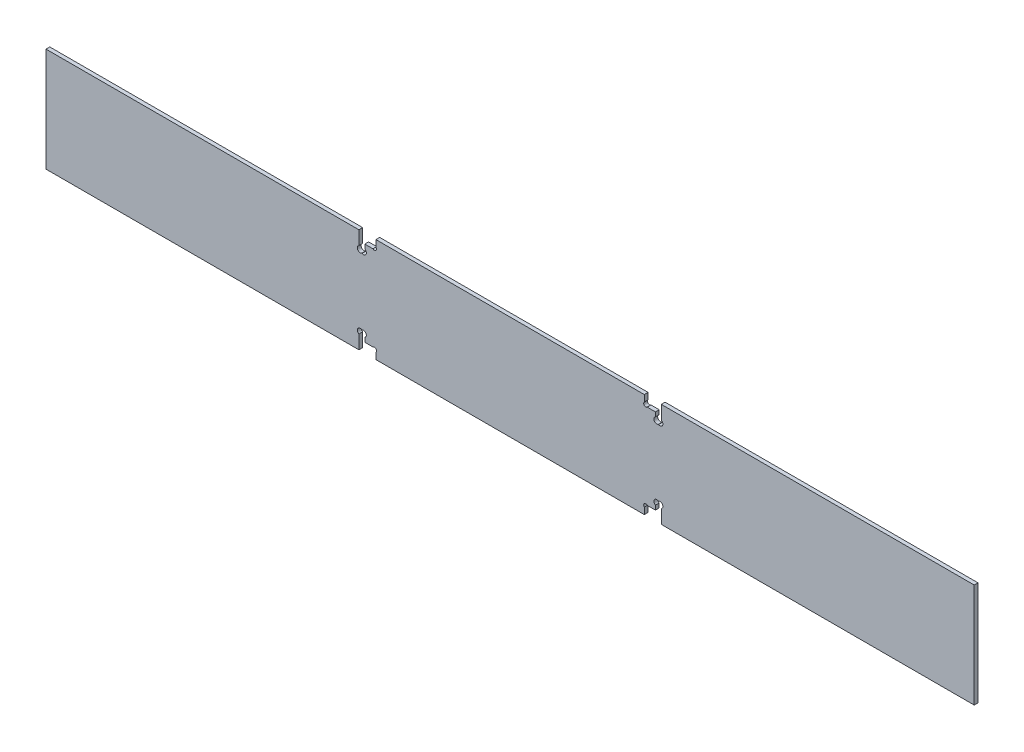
ISO-10303-21;
HEADER;
FILE_DESCRIPTION(('STEP AP214'),'2;1');
FILE_NAME('part.step','',(''),(''),'','','');
FILE_SCHEMA(('AUTOMOTIVE_DESIGN { 1 0 10303 214 1 1 1 1 }'));
ENDSEC;
DATA;
#1=APPLICATION_CONTEXT('core data for automotive mechanical design processes');
#2=APPLICATION_PROTOCOL_DEFINITION('international standard','automotive_design',2000,#1);
#3=PRODUCT_CONTEXT('',#1,'mechanical');
#4=PRODUCT('Part','Part','',(#3));
#5=PRODUCT_RELATED_PRODUCT_CATEGORY('part','',(#4));
#6=PRODUCT_DEFINITION_FORMATION('','',#4);
#7=PRODUCT_DEFINITION_CONTEXT('part definition',#1,'design');
#8=PRODUCT_DEFINITION('design','',#6,#7);
#9=PRODUCT_DEFINITION_SHAPE('','',#8);
#10=(LENGTH_UNIT() NAMED_UNIT(*) SI_UNIT(.MILLI.,.METRE.));
#11=(NAMED_UNIT(*) PLANE_ANGLE_UNIT() SI_UNIT($,.RADIAN.));
#12=(NAMED_UNIT(*) SI_UNIT($,.STERADIAN.) SOLID_ANGLE_UNIT());
#13=UNCERTAINTY_MEASURE_WITH_UNIT(LENGTH_MEASURE(1.E-05),#10,'distance_accuracy_value','');
#14=(GEOMETRIC_REPRESENTATION_CONTEXT(3) GLOBAL_UNCERTAINTY_ASSIGNED_CONTEXT((#13)) GLOBAL_UNIT_ASSIGNED_CONTEXT((#10,
#11,#12)) REPRESENTATION_CONTEXT('',''));
#15=CARTESIAN_POINT('',(0.,0.,0.));
#16=DIRECTION('',(0.,0.,1.));
#17=DIRECTION('',(1.,0.,0.));
#18=AXIS2_PLACEMENT_3D('',#15,#16,#17);
#19=CARTESIAN_POINT('',(-0.5,0.,2.));
#20=DIRECTION('',(1.,0.,0.));
#21=DIRECTION('',(0.,0.,-1.));
#22=AXIS2_PLACEMENT_3D('',#19,#20,#21);
#23=PLANE('',#22);
#24=DIRECTION('',(0.,-1.,0.));
#25=VECTOR('',#24,1.);
#26=CARTESIAN_POINT('',(-0.5,0.,0.));
#27=LINE('',#26,#25);
#28=CARTESIAN_POINT('',(-0.5,55.,0.));
#29=VERTEX_POINT('',#28);
#30=CARTESIAN_POINT('',(-0.5,0.,0.));
#31=VERTEX_POINT('',#30);
#32=EDGE_CURVE('E286',#29,#31,#27,.T.);
#33=ORIENTED_EDGE('',*,*,#32,.T.);
#34=DIRECTION('',(0.,0.,-1.));
#35=VECTOR('',#34,1.);
#36=CARTESIAN_POINT('',(-0.5,0.,2.));
#37=LINE('',#36,#35);
#38=CARTESIAN_POINT('',(-0.5,0.,2.));
#39=VERTEX_POINT('',#38);
#40=EDGE_CURVE('E11',#39,#31,#37,.T.);
#41=ORIENTED_EDGE('',*,*,#40,.F.);
#42=DIRECTION('',(0.,-1.,0.));
#43=VECTOR('',#42,1.);
#44=CARTESIAN_POINT('',(-0.5,0.,2.));
#45=LINE('',#44,#43);
#46=CARTESIAN_POINT('',(-0.5,55.,2.));
#47=VERTEX_POINT('',#46);
#48=EDGE_CURVE('E377',#47,#39,#45,.T.);
#49=ORIENTED_EDGE('',*,*,#48,.F.);
#50=DIRECTION('',(0.,0.,-1.));
#51=VECTOR('',#50,1.);
#52=CARTESIAN_POINT('',(-0.5,55.,2.));
#53=LINE('',#52,#51);
#54=EDGE_CURVE('E299',#47,#29,#53,.T.);
#55=ORIENTED_EDGE('',*,*,#54,.T.);
#56=EDGE_LOOP('',(#33,#41,#49,#55));
#57=FACE_BOUND('',#56,.T.);
#58=ADVANCED_FACE('F26',(#57),#23,.F.);
#59=CARTESIAN_POINT('',(-0.5,0.,2.));
#60=DIRECTION('',(0.,1.,0.));
#61=DIRECTION('',(0.,0.,1.));
#62=AXIS2_PLACEMENT_3D('',#59,#60,#61);
#63=PLANE('',#62);
#64=DIRECTION('',(1.,0.,0.));
#65=VECTOR('',#64,1.);
#66=CARTESIAN_POINT('',(-0.5,0.,0.));
#67=LINE('',#66,#65);
#68=CARTESIAN_POINT('',(165.014156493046,0.,0.));
#69=VERTEX_POINT('',#68);
#70=EDGE_CURVE('E282',#31,#69,#67,.T.);
#71=ORIENTED_EDGE('',*,*,#70,.T.);
#72=DIRECTION('',(0.,0.,-1.));
#73=VECTOR('',#72,1.);
#74=CARTESIAN_POINT('',(165.014156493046,0.,2.));
#75=LINE('',#74,#73);
#76=CARTESIAN_POINT('',(165.014156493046,0.,2.));
#77=VERTEX_POINT('',#76);
#78=EDGE_CURVE('E33',#77,#69,#75,.T.);
#79=ORIENTED_EDGE('',*,*,#78,.F.);
#80=DIRECTION('',(1.,0.,0.));
#81=VECTOR('',#80,1.);
#82=CARTESIAN_POINT('',(-0.5,0.,2.));
#83=LINE('',#82,#81);
#84=EDGE_CURVE('E295',#39,#77,#83,.T.);
#85=ORIENTED_EDGE('',*,*,#84,.F.);
#86=ORIENTED_EDGE('',*,*,#40,.T.);
#87=EDGE_LOOP('',(#71,#79,#85,#86));
#88=FACE_BOUND('',#87,.T.);
#89=ADVANCED_FACE('F294',(#88),#63,.F.);
#90=CARTESIAN_POINT('',(165.014156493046,7.26886275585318,2.));
#91=DIRECTION('',(-1.,0.,0.));
#92=DIRECTION('',(0.,0.,1.));
#93=AXIS2_PLACEMENT_3D('',#90,#91,#92);
#94=PLANE('',#93);
#95=DIRECTION('',(0.,1.,0.));
#96=VECTOR('',#95,1.);
#97=CARTESIAN_POINT('',(165.014156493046,7.26886275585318,0.));
#98=LINE('',#97,#96);
#99=CARTESIAN_POINT('',(165.014156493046,7.26886275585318,0.));
#100=VERTEX_POINT('',#99);
#101=EDGE_CURVE('E288',#69,#100,#98,.T.);
#102=ORIENTED_EDGE('',*,*,#101,.T.);
#103=DIRECTION('',(0.,0.,-1.));
#104=VECTOR('',#103,1.);
#105=CARTESIAN_POINT('',(165.014156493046,7.26886275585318,2.));
#106=LINE('',#105,#104);
#107=CARTESIAN_POINT('',(165.014156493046,7.26886275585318,2.));
#108=VERTEX_POINT('',#107);
#109=EDGE_CURVE('E563',#108,#100,#106,.T.);
#110=ORIENTED_EDGE('',*,*,#109,.F.);
#111=DIRECTION('',(0.,1.,0.));
#112=VECTOR('',#111,1.);
#113=CARTESIAN_POINT('',(165.014156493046,7.26886275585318,2.));
#114=LINE('',#113,#112);
#115=EDGE_CURVE('E380',#77,#108,#114,.T.);
#116=ORIENTED_EDGE('',*,*,#115,.F.);
#117=ORIENTED_EDGE('',*,*,#78,.T.);
#118=EDGE_LOOP('',(#102,#110,#116,#117));
#119=FACE_BOUND('',#118,.T.);
#120=ADVANCED_FACE('F567',(#119),#94,.F.);
#121=CARTESIAN_POINT('',(165.720697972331,8.64846383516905,2.));
#122=DIRECTION('',(0.,0.,-1.));
#123=DIRECTION('',(-1.,0.,0.));
#124=AXIS2_PLACEMENT_3D('',#121,#122,#123);
#125=CYLINDRICAL_SURFACE('',#124,1.55);
#126=CARTESIAN_POINT('',(165.720697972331,8.64846383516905,0.));
#127=DIRECTION('',(0.,0.,-1.));
#128=DIRECTION('',(1.,0.,0.));
#129=AXIS2_PLACEMENT_3D('',#126,#127,#128);
#130=CIRCLE('',#129,1.55);
#131=CARTESIAN_POINT('',(166.479545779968,10.,0.));
#132=VERTEX_POINT('',#131);
#133=EDGE_CURVE('E303',#100,#132,#130,.T.);
#134=ORIENTED_EDGE('',*,*,#133,.T.);
#135=DIRECTION('',(0.,0.,-1.));
#136=VECTOR('',#135,1.);
#137=CARTESIAN_POINT('',(166.479545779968,10.,2.));
#138=LINE('',#137,#136);
#139=CARTESIAN_POINT('',(166.479545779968,10.,2.));
#140=VERTEX_POINT('',#139);
#141=EDGE_CURVE('E560',#140,#132,#138,.T.);
#142=ORIENTED_EDGE('',*,*,#141,.F.);
#143=CARTESIAN_POINT('',(165.720697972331,8.64846383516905,2.));
#144=DIRECTION('',(0.,0.,-1.));
#145=DIRECTION('',(1.,0.,0.));
#146=AXIS2_PLACEMENT_3D('',#143,#144,#145);
#147=CIRCLE('',#146,1.55);
#148=EDGE_CURVE('E382',#108,#140,#147,.T.);
#149=ORIENTED_EDGE('',*,*,#148,.F.);
#150=ORIENTED_EDGE('',*,*,#109,.T.);
#151=EDGE_LOOP('',(#134,#142,#149,#150));
#152=FACE_BOUND('',#151,.T.);
#153=ADVANCED_FACE('F575',(#152),#125,.F.);
#154=CARTESIAN_POINT('',(166.479545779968,10.,2.));
#155=DIRECTION('',(0.,1.,0.));
#156=DIRECTION('',(0.,0.,1.));
#157=AXIS2_PLACEMENT_3D('',#154,#155,#156);
#158=PLANE('',#157);
#159=DIRECTION('',(1.,0.,0.));
#160=VECTOR('',#159,1.);
#161=CARTESIAN_POINT('',(166.479545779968,10.,0.));
#162=LINE('',#161,#160);
#163=CARTESIAN_POINT('',(166.648767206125,10.,0.));
#164=VERTEX_POINT('',#163);
#165=EDGE_CURVE('E305',#132,#164,#162,.T.);
#166=ORIENTED_EDGE('',*,*,#165,.T.);
#167=DIRECTION('',(0.,0.,-1.));
#168=VECTOR('',#167,1.);
#169=CARTESIAN_POINT('',(166.648767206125,10.,2.));
#170=LINE('',#169,#168);
#171=CARTESIAN_POINT('',(166.648767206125,10.,2.));
#172=VERTEX_POINT('',#171);
#173=EDGE_CURVE('E557',#172,#164,#170,.T.);
#174=ORIENTED_EDGE('',*,*,#173,.F.);
#175=DIRECTION('',(1.,0.,0.));
#176=VECTOR('',#175,1.);
#177=CARTESIAN_POINT('',(166.479545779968,10.,2.));
#178=LINE('',#177,#176);
#179=EDGE_CURVE('E384',#140,#172,#178,.T.);
#180=ORIENTED_EDGE('',*,*,#179,.F.);
#181=ORIENTED_EDGE('',*,*,#141,.T.);
#182=EDGE_LOOP('',(#166,#174,#180,#181));
#183=FACE_BOUND('',#182,.T.);
#184=ADVANCED_FACE('F578',(#183),#158,.F.);
#185=CARTESIAN_POINT('',(167.407615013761,8.64846383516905,2.));
#186=DIRECTION('',(0.,0.,-1.));
#187=DIRECTION('',(-1.,0.,0.));
#188=AXIS2_PLACEMENT_3D('',#185,#186,#187);
#189=CYLINDRICAL_SURFACE('',#188,1.55);
#190=CARTESIAN_POINT('',(167.407615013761,8.64846383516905,0.));
#191=DIRECTION('',(0.,0.,-1.));
#192=DIRECTION('',(-1.,0.,0.));
#193=AXIS2_PLACEMENT_3D('',#190,#191,#192);
#194=CIRCLE('',#193,1.55);
#195=CARTESIAN_POINT('',(168.114156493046,7.26886275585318,0.));
#196=VERTEX_POINT('',#195);
#197=EDGE_CURVE('E307',#164,#196,#194,.T.);
#198=ORIENTED_EDGE('',*,*,#197,.T.);
#199=DIRECTION('',(0.,0.,-1.));
#200=VECTOR('',#199,1.);
#201=CARTESIAN_POINT('',(168.114156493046,7.26886275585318,2.));
#202=LINE('',#201,#200);
#203=CARTESIAN_POINT('',(168.114156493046,7.26886275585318,2.));
#204=VERTEX_POINT('',#203);
#205=EDGE_CURVE('E554',#204,#196,#202,.T.);
#206=ORIENTED_EDGE('',*,*,#205,.F.);
#207=CARTESIAN_POINT('',(167.407615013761,8.64846383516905,2.));
#208=DIRECTION('',(0.,0.,-1.));
#209=DIRECTION('',(-1.,0.,0.));
#210=AXIS2_PLACEMENT_3D('',#207,#208,#209);
#211=CIRCLE('',#210,1.55);
#212=EDGE_CURVE('E386',#172,#204,#211,.T.);
#213=ORIENTED_EDGE('',*,*,#212,.F.);
#214=ORIENTED_EDGE('',*,*,#173,.T.);
#215=EDGE_LOOP('',(#198,#206,#213,#214));
#216=FACE_BOUND('',#215,.T.);
#217=ADVANCED_FACE('F583',(#216),#189,.F.);
#218=CARTESIAN_POINT('',(168.114156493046,7.26886275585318,2.));
#219=DIRECTION('',(1.,0.,0.));
#220=DIRECTION('',(0.,0.,-1.));
#221=AXIS2_PLACEMENT_3D('',#218,#219,#220);
#222=PLANE('',#221);
#223=DIRECTION('',(0.,-1.,0.));
#224=VECTOR('',#223,1.);
#225=CARTESIAN_POINT('',(168.114156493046,7.26886275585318,0.));
#226=LINE('',#225,#224);
#227=CARTESIAN_POINT('',(168.114156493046,5.,0.));
#228=VERTEX_POINT('',#227);
#229=EDGE_CURVE('E309',#196,#228,#226,.T.);
#230=ORIENTED_EDGE('',*,*,#229,.T.);
#231=DIRECTION('',(0.,0.,-1.));
#232=VECTOR('',#231,1.);
#233=CARTESIAN_POINT('',(168.114156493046,5.,2.));
#234=LINE('',#233,#232);
#235=CARTESIAN_POINT('',(168.114156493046,5.,2.));
#236=VERTEX_POINT('',#235);
#237=EDGE_CURVE('E551',#236,#228,#234,.T.);
#238=ORIENTED_EDGE('',*,*,#237,.F.);
#239=DIRECTION('',(0.,-1.,0.));
#240=VECTOR('',#239,1.);
#241=CARTESIAN_POINT('',(168.114156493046,7.26886275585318,2.));
#242=LINE('',#241,#240);
#243=EDGE_CURVE('E388',#204,#236,#242,.T.);
#244=ORIENTED_EDGE('',*,*,#243,.F.);
#245=ORIENTED_EDGE('',*,*,#205,.T.);
#246=EDGE_LOOP('',(#230,#238,#244,#245));
#247=FACE_BOUND('',#246,.T.);
#248=ADVANCED_FACE('F589',(#247),#222,.F.);
#249=CARTESIAN_POINT('',(168.114156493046,5.,2.));
#250=DIRECTION('',(0.,1.,0.));
#251=DIRECTION('',(0.,0.,1.));
#252=AXIS2_PLACEMENT_3D('',#249,#250,#251);
#253=PLANE('',#252);
#254=DIRECTION('',(1.,0.,0.));
#255=VECTOR('',#254,1.);
#256=CARTESIAN_POINT('',(168.114156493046,5.,0.));
#257=LINE('',#256,#255);
#258=CARTESIAN_POINT('',(172.44436508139,5.,0.));
#259=VERTEX_POINT('',#258);
#260=EDGE_CURVE('E311',#228,#259,#257,.T.);
#261=ORIENTED_EDGE('',*,*,#260,.T.);
#262=DIRECTION('',(0.,0.,-1.));
#263=VECTOR('',#262,1.);
#264=CARTESIAN_POINT('',(172.44436508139,5.,2.));
#265=LINE('',#264,#263);
#266=CARTESIAN_POINT('',(172.44436508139,5.,2.));
#267=VERTEX_POINT('',#266);
#268=EDGE_CURVE('E548',#267,#259,#265,.T.);
#269=ORIENTED_EDGE('',*,*,#268,.F.);
#270=DIRECTION('',(1.,0.,0.));
#271=VECTOR('',#270,1.);
#272=CARTESIAN_POINT('',(168.114156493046,5.,2.));
#273=LINE('',#272,#271);
#274=EDGE_CURVE('E390',#236,#267,#273,.T.);
#275=ORIENTED_EDGE('',*,*,#274,.F.);
#276=ORIENTED_EDGE('',*,*,#237,.T.);
#277=EDGE_LOOP('',(#261,#269,#275,#276));
#278=FACE_BOUND('',#277,.T.);
#279=ADVANCED_FACE('F593',(#278),#253,.F.);
#280=CARTESIAN_POINT('',(173.229260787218,4.21510429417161,2.));
#281=DIRECTION('',(0.,0.,-1.));
#282=DIRECTION('',(-1.,0.,0.));
#283=AXIS2_PLACEMENT_3D('',#280,#281,#282);
#284=CYLINDRICAL_SURFACE('',#283,1.1100101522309);
#285=CARTESIAN_POINT('',(173.229260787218,4.21510429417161,0.));
#286=DIRECTION('',(0.,0.,-1.));
#287=DIRECTION('',(1.,0.,0.));
#288=AXIS2_PLACEMENT_3D('',#285,#286,#287);
#289=CIRCLE('',#288,1.1100101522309);
#290=CARTESIAN_POINT('',(174.014156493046,3.43020858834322,0.));
#291=VERTEX_POINT('',#290);
#292=EDGE_CURVE('E313',#259,#291,#289,.T.);
#293=ORIENTED_EDGE('',*,*,#292,.T.);
#294=DIRECTION('',(0.,0.,-1.));
#295=VECTOR('',#294,1.);
#296=CARTESIAN_POINT('',(174.014156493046,3.43020858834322,2.));
#297=LINE('',#296,#295);
#298=CARTESIAN_POINT('',(174.014156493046,3.43020858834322,2.));
#299=VERTEX_POINT('',#298);
#300=EDGE_CURVE('E545',#299,#291,#297,.T.);
#301=ORIENTED_EDGE('',*,*,#300,.F.);
#302=CARTESIAN_POINT('',(173.229260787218,4.21510429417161,2.));
#303=DIRECTION('',(0.,0.,-1.));
#304=DIRECTION('',(1.,0.,0.));
#305=AXIS2_PLACEMENT_3D('',#302,#303,#304);
#306=CIRCLE('',#305,1.1100101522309);
#307=EDGE_CURVE('E392',#267,#299,#306,.T.);
#308=ORIENTED_EDGE('',*,*,#307,.F.);
#309=ORIENTED_EDGE('',*,*,#268,.T.);
#310=EDGE_LOOP('',(#293,#301,#308,#309));
#311=FACE_BOUND('',#310,.T.);
#312=ADVANCED_FACE('F598',(#311),#284,.F.);
#313=CARTESIAN_POINT('',(174.014156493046,3.43020858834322,2.));
#314=DIRECTION('',(1.,0.,0.));
#315=DIRECTION('',(0.,0.,-1.));
#316=AXIS2_PLACEMENT_3D('',#313,#314,#315);
#317=PLANE('',#316);
#318=DIRECTION('',(0.,-1.,0.));
#319=VECTOR('',#318,1.);
#320=CARTESIAN_POINT('',(174.014156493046,3.43020858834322,0.));
#321=LINE('',#320,#319);
#322=CARTESIAN_POINT('',(174.014156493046,0.,0.));
#323=VERTEX_POINT('',#322);
#324=EDGE_CURVE('E315',#291,#323,#321,.T.);
#325=ORIENTED_EDGE('',*,*,#324,.T.);
#326=DIRECTION('',(0.,0.,-1.));
#327=VECTOR('',#326,1.);
#328=CARTESIAN_POINT('',(174.014156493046,0.,2.));
#329=LINE('',#328,#327);
#330=CARTESIAN_POINT('',(174.014156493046,0.,2.));
#331=VERTEX_POINT('',#330);
#332=EDGE_CURVE('E542',#331,#323,#329,.T.);
#333=ORIENTED_EDGE('',*,*,#332,.F.);
#334=DIRECTION('',(0.,-1.,0.));
#335=VECTOR('',#334,1.);
#336=CARTESIAN_POINT('',(174.014156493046,3.43020858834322,2.));
#337=LINE('',#336,#335);
#338=EDGE_CURVE('E394',#299,#331,#337,.T.);
#339=ORIENTED_EDGE('',*,*,#338,.F.);
#340=ORIENTED_EDGE('',*,*,#300,.T.);
#341=EDGE_LOOP('',(#325,#333,#339,#340));
#342=FACE_BOUND('',#341,.T.);
#343=ADVANCED_FACE('F604',(#342),#317,.F.);
#344=CARTESIAN_POINT('',(174.014156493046,0.,2.));
#345=DIRECTION('',(0.,1.,0.));
#346=DIRECTION('',(0.,0.,1.));
#347=AXIS2_PLACEMENT_3D('',#344,#345,#346);
#348=PLANE('',#347);
#349=DIRECTION('',(1.,0.,0.));
#350=VECTOR('',#349,1.);
#351=CARTESIAN_POINT('',(174.014156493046,0.,0.));
#352=LINE('',#351,#350);
#353=CARTESIAN_POINT('',(315.985843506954,0.,0.));
#354=VERTEX_POINT('',#353);
#355=EDGE_CURVE('E317',#323,#354,#352,.T.);
#356=ORIENTED_EDGE('',*,*,#355,.T.);
#357=DIRECTION('',(0.,0.,-1.));
#358=VECTOR('',#357,1.);
#359=CARTESIAN_POINT('',(315.985843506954,0.,2.));
#360=LINE('',#359,#358);
#361=CARTESIAN_POINT('',(315.985843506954,0.,2.));
#362=VERTEX_POINT('',#361);
#363=EDGE_CURVE('E539',#362,#354,#360,.T.);
#364=ORIENTED_EDGE('',*,*,#363,.F.);
#365=DIRECTION('',(1.,0.,0.));
#366=VECTOR('',#365,1.);
#367=CARTESIAN_POINT('',(174.014156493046,0.,2.));
#368=LINE('',#367,#366);
#369=EDGE_CURVE('E396',#331,#362,#368,.T.);
#370=ORIENTED_EDGE('',*,*,#369,.F.);
#371=ORIENTED_EDGE('',*,*,#332,.T.);
#372=EDGE_LOOP('',(#356,#364,#370,#371));
#373=FACE_BOUND('',#372,.T.);
#374=ADVANCED_FACE('F608',(#373),#348,.F.);
#375=CARTESIAN_POINT('',(315.985843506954,3.43020858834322,2.));
#376=DIRECTION('',(-1.,0.,0.));
#377=DIRECTION('',(0.,0.,1.));
#378=AXIS2_PLACEMENT_3D('',#375,#376,#377);
#379=PLANE('',#378);
#380=DIRECTION('',(0.,1.,0.));
#381=VECTOR('',#380,1.);
#382=CARTESIAN_POINT('',(315.985843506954,3.43020858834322,0.));
#383=LINE('',#382,#381);
#384=CARTESIAN_POINT('',(315.985843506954,3.43020858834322,0.));
#385=VERTEX_POINT('',#384);
#386=EDGE_CURVE('E319',#354,#385,#383,.T.);
#387=ORIENTED_EDGE('',*,*,#386,.T.);
#388=DIRECTION('',(0.,0.,-1.));
#389=VECTOR('',#388,1.);
#390=CARTESIAN_POINT('',(315.985843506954,3.43020858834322,2.));
#391=LINE('',#390,#389);
#392=CARTESIAN_POINT('',(315.985843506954,3.43020858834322,2.));
#393=VERTEX_POINT('',#392);
#394=EDGE_CURVE('E536',#393,#385,#391,.T.);
#395=ORIENTED_EDGE('',*,*,#394,.F.);
#396=DIRECTION('',(0.,1.,0.));
#397=VECTOR('',#396,1.);
#398=CARTESIAN_POINT('',(315.985843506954,3.43020858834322,2.));
#399=LINE('',#398,#397);
#400=EDGE_CURVE('E398',#362,#393,#399,.T.);
#401=ORIENTED_EDGE('',*,*,#400,.F.);
#402=ORIENTED_EDGE('',*,*,#363,.T.);
#403=EDGE_LOOP('',(#387,#395,#401,#402));
#404=FACE_BOUND('',#403,.T.);
#405=ADVANCED_FACE('F613',(#404),#379,.F.);
#406=CARTESIAN_POINT('',(316.770739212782,4.21510429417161,2.));
#407=DIRECTION('',(0.,0.,-1.));
#408=DIRECTION('',(-1.,0.,0.));
#409=AXIS2_PLACEMENT_3D('',#406,#407,#408);
#410=CYLINDRICAL_SURFACE('',#409,1.11001015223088);
#411=CARTESIAN_POINT('',(316.770739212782,4.21510429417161,0.));
#412=DIRECTION('',(0.,0.,-1.));
#413=DIRECTION('',(-1.,0.,0.));
#414=AXIS2_PLACEMENT_3D('',#411,#412,#413);
#415=CIRCLE('',#414,1.11001015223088);
#416=CARTESIAN_POINT('',(317.55563491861,5.,0.));
#417=VERTEX_POINT('',#416);
#418=EDGE_CURVE('E321',#385,#417,#415,.T.);
#419=ORIENTED_EDGE('',*,*,#418,.T.);
#420=DIRECTION('',(0.,0.,-1.));
#421=VECTOR('',#420,1.);
#422=CARTESIAN_POINT('',(317.55563491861,5.,2.));
#423=LINE('',#422,#421);
#424=CARTESIAN_POINT('',(317.55563491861,5.,2.));
#425=VERTEX_POINT('',#424);
#426=EDGE_CURVE('E533',#425,#417,#423,.T.);
#427=ORIENTED_EDGE('',*,*,#426,.F.);
#428=CARTESIAN_POINT('',(316.770739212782,4.21510429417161,2.));
#429=DIRECTION('',(0.,0.,-1.));
#430=DIRECTION('',(-1.,0.,0.));
#431=AXIS2_PLACEMENT_3D('',#428,#429,#430);
#432=CIRCLE('',#431,1.11001015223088);
#433=EDGE_CURVE('E400',#393,#425,#432,.T.);
#434=ORIENTED_EDGE('',*,*,#433,.F.);
#435=ORIENTED_EDGE('',*,*,#394,.T.);
#436=EDGE_LOOP('',(#419,#427,#434,#435));
#437=FACE_BOUND('',#436,.T.);
#438=ADVANCED_FACE('F619',(#437),#410,.F.);
#439=CARTESIAN_POINT('',(321.885843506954,5.,2.));
#440=DIRECTION('',(0.,1.,0.));
#441=DIRECTION('',(0.,0.,1.));
#442=AXIS2_PLACEMENT_3D('',#439,#440,#441);
#443=PLANE('',#442);
#444=DIRECTION('',(1.,0.,0.));
#445=VECTOR('',#444,1.);
#446=CARTESIAN_POINT('',(321.885843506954,5.,0.));
#447=LINE('',#446,#445);
#448=CARTESIAN_POINT('',(321.885843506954,5.,0.));
#449=VERTEX_POINT('',#448);
#450=EDGE_CURVE('E323',#417,#449,#447,.T.);
#451=ORIENTED_EDGE('',*,*,#450,.T.);
#452=DIRECTION('',(0.,0.,-1.));
#453=VECTOR('',#452,1.);
#454=CARTESIAN_POINT('',(321.885843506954,5.,2.));
#455=LINE('',#454,#453);
#456=CARTESIAN_POINT('',(321.885843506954,5.,2.));
#457=VERTEX_POINT('',#456);
#458=EDGE_CURVE('E530',#457,#449,#455,.T.);
#459=ORIENTED_EDGE('',*,*,#458,.F.);
#460=DIRECTION('',(1.,0.,0.));
#461=VECTOR('',#460,1.);
#462=CARTESIAN_POINT('',(321.885843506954,5.,2.));
#463=LINE('',#462,#461);
#464=EDGE_CURVE('E402',#425,#457,#463,.T.);
#465=ORIENTED_EDGE('',*,*,#464,.F.);
#466=ORIENTED_EDGE('',*,*,#426,.T.);
#467=EDGE_LOOP('',(#451,#459,#465,#466));
#468=FACE_BOUND('',#467,.T.);
#469=ADVANCED_FACE('F623',(#468),#443,.F.);
#470=CARTESIAN_POINT('',(321.885843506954,7.26886275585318,2.));
#471=DIRECTION('',(-1.,0.,0.));
#472=DIRECTION('',(0.,0.,1.));
#473=AXIS2_PLACEMENT_3D('',#470,#471,#472);
#474=PLANE('',#473);
#475=DIRECTION('',(0.,1.,0.));
#476=VECTOR('',#475,1.);
#477=CARTESIAN_POINT('',(321.885843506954,7.26886275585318,0.));
#478=LINE('',#477,#476);
#479=CARTESIAN_POINT('',(321.885843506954,7.26886275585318,0.));
#480=VERTEX_POINT('',#479);
#481=EDGE_CURVE('E325',#449,#480,#478,.T.);
#482=ORIENTED_EDGE('',*,*,#481,.T.);
#483=DIRECTION('',(0.,0.,-1.));
#484=VECTOR('',#483,1.);
#485=CARTESIAN_POINT('',(321.885843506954,7.26886275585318,2.));
#486=LINE('',#485,#484);
#487=CARTESIAN_POINT('',(321.885843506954,7.26886275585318,2.));
#488=VERTEX_POINT('',#487);
#489=EDGE_CURVE('E527',#488,#480,#486,.T.);
#490=ORIENTED_EDGE('',*,*,#489,.F.);
#491=DIRECTION('',(0.,1.,0.));
#492=VECTOR('',#491,1.);
#493=CARTESIAN_POINT('',(321.885843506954,7.26886275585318,2.));
#494=LINE('',#493,#492);
#495=EDGE_CURVE('E404',#457,#488,#494,.T.);
#496=ORIENTED_EDGE('',*,*,#495,.F.);
#497=ORIENTED_EDGE('',*,*,#458,.T.);
#498=EDGE_LOOP('',(#482,#490,#496,#497));
#499=FACE_BOUND('',#498,.T.);
#500=ADVANCED_FACE('F628',(#499),#474,.F.);
#501=CARTESIAN_POINT('',(322.592384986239,8.64846383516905,2.));
#502=DIRECTION('',(0.,0.,-1.));
#503=DIRECTION('',(-1.,0.,0.));
#504=AXIS2_PLACEMENT_3D('',#501,#502,#503);
#505=CYLINDRICAL_SURFACE('',#504,1.54999999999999);
#506=CARTESIAN_POINT('',(322.592384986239,8.64846383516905,0.));
#507=DIRECTION('',(0.,0.,-1.));
#508=DIRECTION('',(1.,0.,0.));
#509=AXIS2_PLACEMENT_3D('',#506,#507,#508);
#510=CIRCLE('',#509,1.54999999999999);
#511=CARTESIAN_POINT('',(323.351232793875,10.,0.));
#512=VERTEX_POINT('',#511);
#513=EDGE_CURVE('E327',#480,#512,#510,.T.);
#514=ORIENTED_EDGE('',*,*,#513,.T.);
#515=DIRECTION('',(0.,0.,-1.));
#516=VECTOR('',#515,1.);
#517=CARTESIAN_POINT('',(323.351232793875,10.,2.));
#518=LINE('',#517,#516);
#519=CARTESIAN_POINT('',(323.351232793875,10.,2.));
#520=VERTEX_POINT('',#519);
#521=EDGE_CURVE('E524',#520,#512,#518,.T.);
#522=ORIENTED_EDGE('',*,*,#521,.F.);
#523=CARTESIAN_POINT('',(322.592384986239,8.64846383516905,2.));
#524=DIRECTION('',(0.,0.,-1.));
#525=DIRECTION('',(1.,0.,0.));
#526=AXIS2_PLACEMENT_3D('',#523,#524,#525);
#527=CIRCLE('',#526,1.54999999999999);
#528=EDGE_CURVE('E406',#488,#520,#527,.T.);
#529=ORIENTED_EDGE('',*,*,#528,.F.);
#530=ORIENTED_EDGE('',*,*,#489,.T.);
#531=EDGE_LOOP('',(#514,#522,#529,#530));
#532=FACE_BOUND('',#531,.T.);
#533=ADVANCED_FACE('F634',(#532),#505,.F.);
#534=CARTESIAN_POINT('',(323.520454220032,10.,2.));
#535=DIRECTION('',(0.,1.,0.));
#536=DIRECTION('',(0.,0.,1.));
#537=AXIS2_PLACEMENT_3D('',#534,#535,#536);
#538=PLANE('',#537);
#539=DIRECTION('',(1.,0.,0.));
#540=VECTOR('',#539,1.);
#541=CARTESIAN_POINT('',(323.520454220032,10.,0.));
#542=LINE('',#541,#540);
#543=CARTESIAN_POINT('',(323.520454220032,10.,0.));
#544=VERTEX_POINT('',#543);
#545=EDGE_CURVE('E329',#512,#544,#542,.T.);
#546=ORIENTED_EDGE('',*,*,#545,.T.);
#547=DIRECTION('',(0.,0.,-1.));
#548=VECTOR('',#547,1.);
#549=CARTESIAN_POINT('',(323.520454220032,10.,2.));
#550=LINE('',#549,#548);
#551=CARTESIAN_POINT('',(323.520454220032,10.,2.));
#552=VERTEX_POINT('',#551);
#553=EDGE_CURVE('E521',#552,#544,#550,.T.);
#554=ORIENTED_EDGE('',*,*,#553,.F.);
#555=DIRECTION('',(1.,0.,0.));
#556=VECTOR('',#555,1.);
#557=CARTESIAN_POINT('',(323.520454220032,10.,2.));
#558=LINE('',#557,#556);
#559=EDGE_CURVE('E408',#520,#552,#558,.T.);
#560=ORIENTED_EDGE('',*,*,#559,.F.);
#561=ORIENTED_EDGE('',*,*,#521,.T.);
#562=EDGE_LOOP('',(#546,#554,#560,#561));
#563=FACE_BOUND('',#562,.T.);
#564=ADVANCED_FACE('F638',(#563),#538,.F.);
#565=CARTESIAN_POINT('',(324.279302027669,8.64846383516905,2.));
#566=DIRECTION('',(0.,0.,-1.));
#567=DIRECTION('',(-1.,0.,0.));
#568=AXIS2_PLACEMENT_3D('',#565,#566,#567);
#569=CYLINDRICAL_SURFACE('',#568,1.55);
#570=CARTESIAN_POINT('',(324.279302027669,8.64846383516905,0.));
#571=DIRECTION('',(0.,0.,-1.));
#572=DIRECTION('',(-1.,0.,0.));
#573=AXIS2_PLACEMENT_3D('',#570,#571,#572);
#574=CIRCLE('',#573,1.55);
#575=CARTESIAN_POINT('',(324.985843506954,7.26886275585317,0.));
#576=VERTEX_POINT('',#575);
#577=EDGE_CURVE('E331',#544,#576,#574,.T.);
#578=ORIENTED_EDGE('',*,*,#577,.T.);
#579=DIRECTION('',(0.,0.,-1.));
#580=VECTOR('',#579,1.);
#581=CARTESIAN_POINT('',(324.985843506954,7.26886275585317,2.));
#582=LINE('',#581,#580);
#583=CARTESIAN_POINT('',(324.985843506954,7.26886275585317,2.));
#584=VERTEX_POINT('',#583);
#585=EDGE_CURVE('E518',#584,#576,#582,.T.);
#586=ORIENTED_EDGE('',*,*,#585,.F.);
#587=CARTESIAN_POINT('',(324.279302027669,8.64846383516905,2.));
#588=DIRECTION('',(0.,0.,-1.));
#589=DIRECTION('',(-1.,0.,0.));
#590=AXIS2_PLACEMENT_3D('',#587,#588,#589);
#591=CIRCLE('',#590,1.55);
#592=EDGE_CURVE('E410',#552,#584,#591,.T.);
#593=ORIENTED_EDGE('',*,*,#592,.F.);
#594=ORIENTED_EDGE('',*,*,#553,.T.);
#595=EDGE_LOOP('',(#578,#586,#593,#594));
#596=FACE_BOUND('',#595,.T.);
#597=ADVANCED_FACE('F643',(#596),#569,.F.);
#598=CARTESIAN_POINT('',(324.985843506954,7.26886275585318,2.));
#599=DIRECTION('',(1.,0.,0.));
#600=DIRECTION('',(0.,0.,-1.));
#601=AXIS2_PLACEMENT_3D('',#598,#599,#600);
#602=PLANE('',#601);
#603=DIRECTION('',(0.,-1.,0.));
#604=VECTOR('',#603,1.);
#605=CARTESIAN_POINT('',(324.985843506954,7.26886275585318,0.));
#606=LINE('',#605,#604);
#607=CARTESIAN_POINT('',(324.985843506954,0.,0.));
#608=VERTEX_POINT('',#607);
#609=EDGE_CURVE('E333',#576,#608,#606,.T.);
#610=ORIENTED_EDGE('',*,*,#609,.T.);
#611=DIRECTION('',(0.,0.,-1.));
#612=VECTOR('',#611,1.);
#613=CARTESIAN_POINT('',(324.985843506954,0.,2.));
#614=LINE('',#613,#612);
#615=CARTESIAN_POINT('',(324.985843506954,0.,2.));
#616=VERTEX_POINT('',#615);
#617=EDGE_CURVE('E515',#616,#608,#614,.T.);
#618=ORIENTED_EDGE('',*,*,#617,.F.);
#619=DIRECTION('',(0.,-1.,0.));
#620=VECTOR('',#619,1.);
#621=CARTESIAN_POINT('',(324.985843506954,7.26886275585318,2.));
#622=LINE('',#621,#620);
#623=EDGE_CURVE('E412',#584,#616,#622,.T.);
#624=ORIENTED_EDGE('',*,*,#623,.F.);
#625=ORIENTED_EDGE('',*,*,#585,.T.);
#626=EDGE_LOOP('',(#610,#618,#624,#625));
#627=FACE_BOUND('',#626,.T.);
#628=ADVANCED_FACE('F649',(#627),#602,.F.);
#629=CARTESIAN_POINT('',(324.985843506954,0.,2.));
#630=DIRECTION('',(0.,1.,0.));
#631=DIRECTION('',(0.,0.,1.));
#632=AXIS2_PLACEMENT_3D('',#629,#630,#631);
#633=PLANE('',#632);
#634=DIRECTION('',(1.,0.,0.));
#635=VECTOR('',#634,1.);
#636=CARTESIAN_POINT('',(324.985843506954,0.,0.));
#637=LINE('',#636,#635);
#638=CARTESIAN_POINT('',(490.5,0.,0.));
#639=VERTEX_POINT('',#638);
#640=EDGE_CURVE('E335',#608,#639,#637,.T.);
#641=ORIENTED_EDGE('',*,*,#640,.T.);
#642=DIRECTION('',(0.,0.,-1.));
#643=VECTOR('',#642,1.);
#644=CARTESIAN_POINT('',(490.5,0.,2.));
#645=LINE('',#644,#643);
#646=CARTESIAN_POINT('',(490.5,0.,2.));
#647=VERTEX_POINT('',#646);
#648=EDGE_CURVE('E512',#647,#639,#645,.T.);
#649=ORIENTED_EDGE('',*,*,#648,.F.);
#650=DIRECTION('',(1.,0.,0.));
#651=VECTOR('',#650,1.);
#652=CARTESIAN_POINT('',(324.985843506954,0.,2.));
#653=LINE('',#652,#651);
#654=EDGE_CURVE('E414',#616,#647,#653,.T.);
#655=ORIENTED_EDGE('',*,*,#654,.F.);
#656=ORIENTED_EDGE('',*,*,#617,.T.);
#657=EDGE_LOOP('',(#641,#649,#655,#656));
#658=FACE_BOUND('',#657,.T.);
#659=ADVANCED_FACE('F653',(#658),#633,.F.);
#660=CARTESIAN_POINT('',(490.5,0.,2.));
#661=DIRECTION('',(-1.,0.,0.));
#662=DIRECTION('',(0.,0.,1.));
#663=AXIS2_PLACEMENT_3D('',#660,#661,#662);
#664=PLANE('',#663);
#665=DIRECTION('',(0.,1.,0.));
#666=VECTOR('',#665,1.);
#667=CARTESIAN_POINT('',(490.5,0.,0.));
#668=LINE('',#667,#666);
#669=CARTESIAN_POINT('',(490.5,55.,0.));
#670=VERTEX_POINT('',#669);
#671=EDGE_CURVE('E337',#639,#670,#668,.T.);
#672=ORIENTED_EDGE('',*,*,#671,.T.);
#673=DIRECTION('',(0.,0.,-1.));
#674=VECTOR('',#673,1.);
#675=CARTESIAN_POINT('',(490.5,55.,2.));
#676=LINE('',#675,#674);
#677=CARTESIAN_POINT('',(490.5,55.,2.));
#678=VERTEX_POINT('',#677);
#679=EDGE_CURVE('E509',#678,#670,#676,.T.);
#680=ORIENTED_EDGE('',*,*,#679,.F.);
#681=DIRECTION('',(0.,1.,0.));
#682=VECTOR('',#681,1.);
#683=CARTESIAN_POINT('',(490.5,0.,2.));
#684=LINE('',#683,#682);
#685=EDGE_CURVE('E416',#647,#678,#684,.T.);
#686=ORIENTED_EDGE('',*,*,#685,.F.);
#687=ORIENTED_EDGE('',*,*,#648,.T.);
#688=EDGE_LOOP('',(#672,#680,#686,#687));
#689=FACE_BOUND('',#688,.T.);
#690=ADVANCED_FACE('F658',(#689),#664,.F.);
#691=CARTESIAN_POINT('',(324.985843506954,55.,2.));
#692=DIRECTION('',(0.,-1.,0.));
#693=DIRECTION('',(0.,0.,-1.));
#694=AXIS2_PLACEMENT_3D('',#691,#692,#693);
#695=PLANE('',#694);
#696=DIRECTION('',(-1.,0.,0.));
#697=VECTOR('',#696,1.);
#698=CARTESIAN_POINT('',(324.985843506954,55.,0.));
#699=LINE('',#698,#697);
#700=CARTESIAN_POINT('',(324.985843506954,55.,0.));
#701=VERTEX_POINT('',#700);
#702=EDGE_CURVE('E339',#670,#701,#699,.T.);
#703=ORIENTED_EDGE('',*,*,#702,.T.);
#704=DIRECTION('',(0.,0.,-1.));
#705=VECTOR('',#704,1.);
#706=CARTESIAN_POINT('',(324.985843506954,55.,2.));
#707=LINE('',#706,#705);
#708=CARTESIAN_POINT('',(324.985843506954,55.,2.));
#709=VERTEX_POINT('',#708);
#710=EDGE_CURVE('E506',#709,#701,#707,.T.);
#711=ORIENTED_EDGE('',*,*,#710,.F.);
#712=DIRECTION('',(-1.,0.,0.));
#713=VECTOR('',#712,1.);
#714=CARTESIAN_POINT('',(324.985843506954,55.,2.));
#715=LINE('',#714,#713);
#716=EDGE_CURVE('E418',#678,#709,#715,.T.);
#717=ORIENTED_EDGE('',*,*,#716,.F.);
#718=ORIENTED_EDGE('',*,*,#679,.T.);
#719=EDGE_LOOP('',(#703,#711,#717,#718));
#720=FACE_BOUND('',#719,.T.);
#721=ADVANCED_FACE('F664',(#720),#695,.F.);
#722=CARTESIAN_POINT('',(324.985843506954,47.7311372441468,2.));
#723=DIRECTION('',(1.,0.,0.));
#724=DIRECTION('',(0.,0.,-1.));
#725=AXIS2_PLACEMENT_3D('',#722,#723,#724);
#726=PLANE('',#725);
#727=DIRECTION('',(0.,-1.,0.));
#728=VECTOR('',#727,1.);
#729=CARTESIAN_POINT('',(324.985843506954,47.7311372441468,0.));
#730=LINE('',#729,#728);
#731=CARTESIAN_POINT('',(324.985843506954,47.7311372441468,0.));
#732=VERTEX_POINT('',#731);
#733=EDGE_CURVE('E341',#701,#732,#730,.T.);
#734=ORIENTED_EDGE('',*,*,#733,.T.);
#735=DIRECTION('',(0.,0.,-1.));
#736=VECTOR('',#735,1.);
#737=CARTESIAN_POINT('',(324.985843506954,47.7311372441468,2.));
#738=LINE('',#737,#736);
#739=CARTESIAN_POINT('',(324.985843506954,47.7311372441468,2.));
#740=VERTEX_POINT('',#739);
#741=EDGE_CURVE('E503',#740,#732,#738,.T.);
#742=ORIENTED_EDGE('',*,*,#741,.F.);
#743=DIRECTION('',(0.,-1.,0.));
#744=VECTOR('',#743,1.);
#745=CARTESIAN_POINT('',(324.985843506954,47.7311372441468,2.));
#746=LINE('',#745,#744);
#747=EDGE_CURVE('E420',#709,#740,#746,.T.);
#748=ORIENTED_EDGE('',*,*,#747,.F.);
#749=ORIENTED_EDGE('',*,*,#710,.T.);
#750=EDGE_LOOP('',(#734,#742,#748,#749));
#751=FACE_BOUND('',#750,.T.);
#752=ADVANCED_FACE('F668',(#751),#726,.F.);
#753=CARTESIAN_POINT('',(324.279302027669,46.351536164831,2.));
#754=DIRECTION('',(0.,0.,-1.));
#755=DIRECTION('',(-1.,0.,0.));
#756=AXIS2_PLACEMENT_3D('',#753,#754,#755);
#757=CYLINDRICAL_SURFACE('',#756,1.55);
#758=CARTESIAN_POINT('',(324.279302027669,46.351536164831,0.));
#759=DIRECTION('',(0.,0.,-1.));
#760=DIRECTION('',(1.,0.,0.));
#761=AXIS2_PLACEMENT_3D('',#758,#759,#760);
#762=CIRCLE('',#761,1.55);
#763=CARTESIAN_POINT('',(323.520454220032,45.,0.));
#764=VERTEX_POINT('',#763);
#765=EDGE_CURVE('E343',#732,#764,#762,.T.);
#766=ORIENTED_EDGE('',*,*,#765,.T.);
#767=DIRECTION('',(0.,0.,-1.));
#768=VECTOR('',#767,1.);
#769=CARTESIAN_POINT('',(323.520454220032,45.,2.));
#770=LINE('',#769,#768);
#771=CARTESIAN_POINT('',(323.520454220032,45.,2.));
#772=VERTEX_POINT('',#771);
#773=EDGE_CURVE('E500',#772,#764,#770,.T.);
#774=ORIENTED_EDGE('',*,*,#773,.F.);
#775=CARTESIAN_POINT('',(324.279302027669,46.351536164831,2.));
#776=DIRECTION('',(0.,0.,-1.));
#777=DIRECTION('',(1.,0.,0.));
#778=AXIS2_PLACEMENT_3D('',#775,#776,#777);
#779=CIRCLE('',#778,1.55);
#780=EDGE_CURVE('E422',#740,#772,#779,.T.);
#781=ORIENTED_EDGE('',*,*,#780,.F.);
#782=ORIENTED_EDGE('',*,*,#741,.T.);
#783=EDGE_LOOP('',(#766,#774,#781,#782));
#784=FACE_BOUND('',#783,.T.);
#785=ADVANCED_FACE('F673',(#784),#757,.F.);
#786=CARTESIAN_POINT('',(323.520454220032,45.,2.));
#787=DIRECTION('',(0.,-1.,0.));
#788=DIRECTION('',(0.,0.,-1.));
#789=AXIS2_PLACEMENT_3D('',#786,#787,#788);
#790=PLANE('',#789);
#791=DIRECTION('',(-1.,0.,0.));
#792=VECTOR('',#791,1.);
#793=CARTESIAN_POINT('',(323.520454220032,45.,0.));
#794=LINE('',#793,#792);
#795=CARTESIAN_POINT('',(323.351232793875,45.,0.));
#796=VERTEX_POINT('',#795);
#797=EDGE_CURVE('E345',#764,#796,#794,.T.);
#798=ORIENTED_EDGE('',*,*,#797,.T.);
#799=DIRECTION('',(0.,0.,-1.));
#800=VECTOR('',#799,1.);
#801=CARTESIAN_POINT('',(323.351232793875,45.,2.));
#802=LINE('',#801,#800);
#803=CARTESIAN_POINT('',(323.351232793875,45.,2.));
#804=VERTEX_POINT('',#803);
#805=EDGE_CURVE('E497',#804,#796,#802,.T.);
#806=ORIENTED_EDGE('',*,*,#805,.F.);
#807=DIRECTION('',(-1.,0.,0.));
#808=VECTOR('',#807,1.);
#809=CARTESIAN_POINT('',(323.520454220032,45.,2.));
#810=LINE('',#809,#808);
#811=EDGE_CURVE('E424',#772,#804,#810,.T.);
#812=ORIENTED_EDGE('',*,*,#811,.F.);
#813=ORIENTED_EDGE('',*,*,#773,.T.);
#814=EDGE_LOOP('',(#798,#806,#812,#813));
#815=FACE_BOUND('',#814,.T.);
#816=ADVANCED_FACE('F679',(#815),#790,.F.);
#817=CARTESIAN_POINT('',(322.592384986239,46.351536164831,2.));
#818=DIRECTION('',(0.,0.,-1.));
#819=DIRECTION('',(-1.,0.,0.));
#820=AXIS2_PLACEMENT_3D('',#817,#818,#819);
#821=CYLINDRICAL_SURFACE('',#820,1.54999999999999);
#822=CARTESIAN_POINT('',(322.592384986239,46.351536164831,0.));
#823=DIRECTION('',(0.,0.,-1.));
#824=DIRECTION('',(-1.,0.,0.));
#825=AXIS2_PLACEMENT_3D('',#822,#823,#824);
#826=CIRCLE('',#825,1.54999999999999);
#827=CARTESIAN_POINT('',(321.885843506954,47.7311372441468,0.));
#828=VERTEX_POINT('',#827);
#829=EDGE_CURVE('E347',#796,#828,#826,.T.);
#830=ORIENTED_EDGE('',*,*,#829,.T.);
#831=DIRECTION('',(0.,0.,-1.));
#832=VECTOR('',#831,1.);
#833=CARTESIAN_POINT('',(321.885843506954,47.7311372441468,2.));
#834=LINE('',#833,#832);
#835=CARTESIAN_POINT('',(321.885843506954,47.7311372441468,2.));
#836=VERTEX_POINT('',#835);
#837=EDGE_CURVE('E494',#836,#828,#834,.T.);
#838=ORIENTED_EDGE('',*,*,#837,.F.);
#839=CARTESIAN_POINT('',(322.592384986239,46.351536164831,2.));
#840=DIRECTION('',(0.,0.,-1.));
#841=DIRECTION('',(-1.,0.,0.));
#842=AXIS2_PLACEMENT_3D('',#839,#840,#841);
#843=CIRCLE('',#842,1.54999999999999);
#844=EDGE_CURVE('E426',#804,#836,#843,.T.);
#845=ORIENTED_EDGE('',*,*,#844,.F.);
#846=ORIENTED_EDGE('',*,*,#805,.T.);
#847=EDGE_LOOP('',(#830,#838,#845,#846));
#848=FACE_BOUND('',#847,.T.);
#849=ADVANCED_FACE('F683',(#848),#821,.F.);
#850=CARTESIAN_POINT('',(321.885843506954,47.7311372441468,2.));
#851=DIRECTION('',(-1.,0.,0.));
#852=DIRECTION('',(0.,0.,1.));
#853=AXIS2_PLACEMENT_3D('',#850,#851,#852);
#854=PLANE('',#853);
#855=DIRECTION('',(0.,1.,0.));
#856=VECTOR('',#855,1.);
#857=CARTESIAN_POINT('',(321.885843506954,47.7311372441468,0.));
#858=LINE('',#857,#856);
#859=CARTESIAN_POINT('',(321.885843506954,50.,0.));
#860=VERTEX_POINT('',#859);
#861=EDGE_CURVE('E349',#828,#860,#858,.T.);
#862=ORIENTED_EDGE('',*,*,#861,.T.);
#863=DIRECTION('',(0.,0.,-1.));
#864=VECTOR('',#863,1.);
#865=CARTESIAN_POINT('',(321.885843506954,50.,2.));
#866=LINE('',#865,#864);
#867=CARTESIAN_POINT('',(321.885843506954,50.,2.));
#868=VERTEX_POINT('',#867);
#869=EDGE_CURVE('E491',#868,#860,#866,.T.);
#870=ORIENTED_EDGE('',*,*,#869,.F.);
#871=DIRECTION('',(0.,1.,0.));
#872=VECTOR('',#871,1.);
#873=CARTESIAN_POINT('',(321.885843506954,47.7311372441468,2.));
#874=LINE('',#873,#872);
#875=EDGE_CURVE('E428',#836,#868,#874,.T.);
#876=ORIENTED_EDGE('',*,*,#875,.F.);
#877=ORIENTED_EDGE('',*,*,#837,.T.);
#878=EDGE_LOOP('',(#862,#870,#876,#877));
#879=FACE_BOUND('',#878,.T.);
#880=ADVANCED_FACE('F688',(#879),#854,.F.);
#881=CARTESIAN_POINT('',(321.885843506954,50.,2.));
#882=DIRECTION('',(0.,-1.,0.));
#883=DIRECTION('',(0.,0.,-1.));
#884=AXIS2_PLACEMENT_3D('',#881,#882,#883);
#885=PLANE('',#884);
#886=DIRECTION('',(-1.,0.,0.));
#887=VECTOR('',#886,1.);
#888=CARTESIAN_POINT('',(321.885843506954,50.,0.));
#889=LINE('',#888,#887);
#890=CARTESIAN_POINT('',(317.55563491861,50.,0.));
#891=VERTEX_POINT('',#890);
#892=EDGE_CURVE('E351',#860,#891,#889,.T.);
#893=ORIENTED_EDGE('',*,*,#892,.T.);
#894=DIRECTION('',(0.,0.,-1.));
#895=VECTOR('',#894,1.);
#896=CARTESIAN_POINT('',(317.55563491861,50.,2.));
#897=LINE('',#896,#895);
#898=CARTESIAN_POINT('',(317.55563491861,50.,2.));
#899=VERTEX_POINT('',#898);
#900=EDGE_CURVE('E488',#899,#891,#897,.T.);
#901=ORIENTED_EDGE('',*,*,#900,.F.);
#902=DIRECTION('',(-1.,0.,0.));
#903=VECTOR('',#902,1.);
#904=CARTESIAN_POINT('',(321.885843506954,50.,2.));
#905=LINE('',#904,#903);
#906=EDGE_CURVE('E430',#868,#899,#905,.T.);
#907=ORIENTED_EDGE('',*,*,#906,.F.);
#908=ORIENTED_EDGE('',*,*,#869,.T.);
#909=EDGE_LOOP('',(#893,#901,#907,#908));
#910=FACE_BOUND('',#909,.T.);
#911=ADVANCED_FACE('F694',(#910),#885,.F.);
#912=CARTESIAN_POINT('',(316.770739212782,50.7848957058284,2.));
#913=DIRECTION('',(0.,0.,-1.));
#914=DIRECTION('',(-1.,0.,0.));
#915=AXIS2_PLACEMENT_3D('',#912,#913,#914);
#916=CYLINDRICAL_SURFACE('',#915,1.11001015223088);
#917=CARTESIAN_POINT('',(316.770739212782,50.7848957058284,0.));
#918=DIRECTION('',(0.,0.,-1.));
#919=DIRECTION('',(1.,0.,0.));
#920=AXIS2_PLACEMENT_3D('',#917,#918,#919);
#921=CIRCLE('',#920,1.11001015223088);
#922=CARTESIAN_POINT('',(315.985843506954,51.5697914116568,0.));
#923=VERTEX_POINT('',#922);
#924=EDGE_CURVE('E353',#891,#923,#921,.T.);
#925=ORIENTED_EDGE('',*,*,#924,.T.);
#926=DIRECTION('',(0.,0.,-1.));
#927=VECTOR('',#926,1.);
#928=CARTESIAN_POINT('',(315.985843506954,51.5697914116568,2.));
#929=LINE('',#928,#927);
#930=CARTESIAN_POINT('',(315.985843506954,51.5697914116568,2.));
#931=VERTEX_POINT('',#930);
#932=EDGE_CURVE('E485',#931,#923,#929,.T.);
#933=ORIENTED_EDGE('',*,*,#932,.F.);
#934=CARTESIAN_POINT('',(316.770739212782,50.7848957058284,2.));
#935=DIRECTION('',(0.,0.,-1.));
#936=DIRECTION('',(1.,0.,0.));
#937=AXIS2_PLACEMENT_3D('',#934,#935,#936);
#938=CIRCLE('',#937,1.11001015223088);
#939=EDGE_CURVE('E432',#899,#931,#938,.T.);
#940=ORIENTED_EDGE('',*,*,#939,.F.);
#941=ORIENTED_EDGE('',*,*,#900,.T.);
#942=EDGE_LOOP('',(#925,#933,#940,#941));
#943=FACE_BOUND('',#942,.T.);
#944=ADVANCED_FACE('F698',(#943),#916,.F.);
#945=CARTESIAN_POINT('',(315.985843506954,51.5697914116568,2.));
#946=DIRECTION('',(-1.,0.,0.));
#947=DIRECTION('',(0.,0.,1.));
#948=AXIS2_PLACEMENT_3D('',#945,#946,#947);
#949=PLANE('',#948);
#950=DIRECTION('',(0.,1.,0.));
#951=VECTOR('',#950,1.);
#952=CARTESIAN_POINT('',(315.985843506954,51.5697914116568,0.));
#953=LINE('',#952,#951);
#954=CARTESIAN_POINT('',(315.985843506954,55.,0.));
#955=VERTEX_POINT('',#954);
#956=EDGE_CURVE('E355',#923,#955,#953,.T.);
#957=ORIENTED_EDGE('',*,*,#956,.T.);
#958=DIRECTION('',(0.,0.,-1.));
#959=VECTOR('',#958,1.);
#960=CARTESIAN_POINT('',(315.985843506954,55.,2.));
#961=LINE('',#960,#959);
#962=CARTESIAN_POINT('',(315.985843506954,55.,2.));
#963=VERTEX_POINT('',#962);
#964=EDGE_CURVE('E482',#963,#955,#961,.T.);
#965=ORIENTED_EDGE('',*,*,#964,.F.);
#966=DIRECTION('',(0.,1.,0.));
#967=VECTOR('',#966,1.);
#968=CARTESIAN_POINT('',(315.985843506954,51.5697914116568,2.));
#969=LINE('',#968,#967);
#970=EDGE_CURVE('E434',#931,#963,#969,.T.);
#971=ORIENTED_EDGE('',*,*,#970,.F.);
#972=ORIENTED_EDGE('',*,*,#932,.T.);
#973=EDGE_LOOP('',(#957,#965,#971,#972));
#974=FACE_BOUND('',#973,.T.);
#975=ADVANCED_FACE('F703',(#974),#949,.F.);
#976=CARTESIAN_POINT('',(174.014156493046,55.,2.));
#977=DIRECTION('',(0.,-1.,0.));
#978=DIRECTION('',(0.,0.,-1.));
#979=AXIS2_PLACEMENT_3D('',#976,#977,#978);
#980=PLANE('',#979);
#981=DIRECTION('',(-1.,0.,0.));
#982=VECTOR('',#981,1.);
#983=CARTESIAN_POINT('',(174.014156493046,55.,0.));
#984=LINE('',#983,#982);
#985=CARTESIAN_POINT('',(174.014156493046,55.,0.));
#986=VERTEX_POINT('',#985);
#987=EDGE_CURVE('E357',#955,#986,#984,.T.);
#988=ORIENTED_EDGE('',*,*,#987,.T.);
#989=DIRECTION('',(0.,0.,-1.));
#990=VECTOR('',#989,1.);
#991=CARTESIAN_POINT('',(174.014156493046,55.,2.));
#992=LINE('',#991,#990);
#993=CARTESIAN_POINT('',(174.014156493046,55.,2.));
#994=VERTEX_POINT('',#993);
#995=EDGE_CURVE('E479',#994,#986,#992,.T.);
#996=ORIENTED_EDGE('',*,*,#995,.F.);
#997=DIRECTION('',(-1.,0.,0.));
#998=VECTOR('',#997,1.);
#999=CARTESIAN_POINT('',(174.014156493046,55.,2.));
#1000=LINE('',#999,#998);
#1001=EDGE_CURVE('E436',#963,#994,#1000,.T.);
#1002=ORIENTED_EDGE('',*,*,#1001,.F.);
#1003=ORIENTED_EDGE('',*,*,#964,.T.);
#1004=EDGE_LOOP('',(#988,#996,#1002,#1003));
#1005=FACE_BOUND('',#1004,.T.);
#1006=ADVANCED_FACE('F709',(#1005),#980,.F.);
#1007=CARTESIAN_POINT('',(174.014156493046,51.5697914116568,2.));
#1008=DIRECTION('',(1.,0.,0.));
#1009=DIRECTION('',(0.,0.,-1.));
#1010=AXIS2_PLACEMENT_3D('',#1007,#1008,#1009);
#1011=PLANE('',#1010);
#1012=DIRECTION('',(0.,-1.,0.));
#1013=VECTOR('',#1012,1.);
#1014=CARTESIAN_POINT('',(174.014156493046,51.5697914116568,0.));
#1015=LINE('',#1014,#1013);
#1016=CARTESIAN_POINT('',(174.014156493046,51.5697914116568,0.));
#1017=VERTEX_POINT('',#1016);
#1018=EDGE_CURVE('E359',#986,#1017,#1015,.T.);
#1019=ORIENTED_EDGE('',*,*,#1018,.T.);
#1020=DIRECTION('',(0.,0.,-1.));
#1021=VECTOR('',#1020,1.);
#1022=CARTESIAN_POINT('',(174.014156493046,51.5697914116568,2.));
#1023=LINE('',#1022,#1021);
#1024=CARTESIAN_POINT('',(174.014156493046,51.5697914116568,2.));
#1025=VERTEX_POINT('',#1024);
#1026=EDGE_CURVE('E476',#1025,#1017,#1023,.T.);
#1027=ORIENTED_EDGE('',*,*,#1026,.F.);
#1028=DIRECTION('',(0.,-1.,0.));
#1029=VECTOR('',#1028,1.);
#1030=CARTESIAN_POINT('',(174.014156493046,51.5697914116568,2.));
#1031=LINE('',#1030,#1029);
#1032=EDGE_CURVE('E438',#994,#1025,#1031,.T.);
#1033=ORIENTED_EDGE('',*,*,#1032,.F.);
#1034=ORIENTED_EDGE('',*,*,#995,.T.);
#1035=EDGE_LOOP('',(#1019,#1027,#1033,#1034));
#1036=FACE_BOUND('',#1035,.T.);
#1037=ADVANCED_FACE('F713',(#1036),#1011,.F.);
#1038=CARTESIAN_POINT('',(173.229260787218,50.7848957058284,2.));
#1039=DIRECTION('',(0.,0.,-1.));
#1040=DIRECTION('',(-1.,0.,0.));
#1041=AXIS2_PLACEMENT_3D('',#1038,#1039,#1040);
#1042=CYLINDRICAL_SURFACE('',#1041,1.1100101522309);
#1043=CARTESIAN_POINT('',(173.229260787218,50.7848957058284,0.));
#1044=DIRECTION('',(0.,0.,-1.));
#1045=DIRECTION('',(-1.,0.,0.));
#1046=AXIS2_PLACEMENT_3D('',#1043,#1044,#1045);
#1047=CIRCLE('',#1046,1.1100101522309);
#1048=CARTESIAN_POINT('',(172.44436508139,50.,0.));
#1049=VERTEX_POINT('',#1048);
#1050=EDGE_CURVE('E361',#1017,#1049,#1047,.T.);
#1051=ORIENTED_EDGE('',*,*,#1050,.T.);
#1052=DIRECTION('',(0.,0.,-1.));
#1053=VECTOR('',#1052,1.);
#1054=CARTESIAN_POINT('',(172.44436508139,50.,2.));
#1055=LINE('',#1054,#1053);
#1056=CARTESIAN_POINT('',(172.44436508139,50.,2.));
#1057=VERTEX_POINT('',#1056);
#1058=EDGE_CURVE('E473',#1057,#1049,#1055,.T.);
#1059=ORIENTED_EDGE('',*,*,#1058,.F.);
#1060=CARTESIAN_POINT('',(173.229260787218,50.7848957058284,2.));
#1061=DIRECTION('',(0.,0.,-1.));
#1062=DIRECTION('',(-1.,0.,0.));
#1063=AXIS2_PLACEMENT_3D('',#1060,#1061,#1062);
#1064=CIRCLE('',#1063,1.1100101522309);
#1065=EDGE_CURVE('E440',#1025,#1057,#1064,.T.);
#1066=ORIENTED_EDGE('',*,*,#1065,.F.);
#1067=ORIENTED_EDGE('',*,*,#1026,.T.);
#1068=EDGE_LOOP('',(#1051,#1059,#1066,#1067));
#1069=FACE_BOUND('',#1068,.T.);
#1070=ADVANCED_FACE('F718',(#1069),#1042,.F.);
#1071=CARTESIAN_POINT('',(168.114156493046,50.,2.));
#1072=DIRECTION('',(0.,-1.,0.));
#1073=DIRECTION('',(0.,0.,-1.));
#1074=AXIS2_PLACEMENT_3D('',#1071,#1072,#1073);
#1075=PLANE('',#1074);
#1076=DIRECTION('',(-1.,0.,0.));
#1077=VECTOR('',#1076,1.);
#1078=CARTESIAN_POINT('',(168.114156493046,50.,0.));
#1079=LINE('',#1078,#1077);
#1080=CARTESIAN_POINT('',(168.114156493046,50.,0.));
#1081=VERTEX_POINT('',#1080);
#1082=EDGE_CURVE('E363',#1049,#1081,#1079,.T.);
#1083=ORIENTED_EDGE('',*,*,#1082,.T.);
#1084=DIRECTION('',(0.,0.,-1.));
#1085=VECTOR('',#1084,1.);
#1086=CARTESIAN_POINT('',(168.114156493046,50.,2.));
#1087=LINE('',#1086,#1085);
#1088=CARTESIAN_POINT('',(168.114156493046,50.,2.));
#1089=VERTEX_POINT('',#1088);
#1090=EDGE_CURVE('E470',#1089,#1081,#1087,.T.);
#1091=ORIENTED_EDGE('',*,*,#1090,.F.);
#1092=DIRECTION('',(-1.,0.,0.));
#1093=VECTOR('',#1092,1.);
#1094=CARTESIAN_POINT('',(168.114156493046,50.,2.));
#1095=LINE('',#1094,#1093);
#1096=EDGE_CURVE('E442',#1057,#1089,#1095,.T.);
#1097=ORIENTED_EDGE('',*,*,#1096,.F.);
#1098=ORIENTED_EDGE('',*,*,#1058,.T.);
#1099=EDGE_LOOP('',(#1083,#1091,#1097,#1098));
#1100=FACE_BOUND('',#1099,.T.);
#1101=ADVANCED_FACE('F724',(#1100),#1075,.F.);
#1102=CARTESIAN_POINT('',(168.114156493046,47.7311372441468,2.));
#1103=DIRECTION('',(1.,0.,0.));
#1104=DIRECTION('',(0.,0.,-1.));
#1105=AXIS2_PLACEMENT_3D('',#1102,#1103,#1104);
#1106=PLANE('',#1105);
#1107=DIRECTION('',(0.,-1.,0.));
#1108=VECTOR('',#1107,1.);
#1109=CARTESIAN_POINT('',(168.114156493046,47.7311372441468,0.));
#1110=LINE('',#1109,#1108);
#1111=CARTESIAN_POINT('',(168.114156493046,47.7311372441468,0.));
#1112=VERTEX_POINT('',#1111);
#1113=EDGE_CURVE('E365',#1081,#1112,#1110,.T.);
#1114=ORIENTED_EDGE('',*,*,#1113,.T.);
#1115=DIRECTION('',(0.,0.,-1.));
#1116=VECTOR('',#1115,1.);
#1117=CARTESIAN_POINT('',(168.114156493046,47.7311372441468,2.));
#1118=LINE('',#1117,#1116);
#1119=CARTESIAN_POINT('',(168.114156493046,47.7311372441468,2.));
#1120=VERTEX_POINT('',#1119);
#1121=EDGE_CURVE('E467',#1120,#1112,#1118,.T.);
#1122=ORIENTED_EDGE('',*,*,#1121,.F.);
#1123=DIRECTION('',(0.,-1.,0.));
#1124=VECTOR('',#1123,1.);
#1125=CARTESIAN_POINT('',(168.114156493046,47.7311372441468,2.));
#1126=LINE('',#1125,#1124);
#1127=EDGE_CURVE('E444',#1089,#1120,#1126,.T.);
#1128=ORIENTED_EDGE('',*,*,#1127,.F.);
#1129=ORIENTED_EDGE('',*,*,#1090,.T.);
#1130=EDGE_LOOP('',(#1114,#1122,#1128,#1129));
#1131=FACE_BOUND('',#1130,.T.);
#1132=ADVANCED_FACE('F728',(#1131),#1106,.F.);
#1133=CARTESIAN_POINT('',(167.407615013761,46.351536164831,2.));
#1134=DIRECTION('',(0.,0.,-1.));
#1135=DIRECTION('',(-1.,0.,0.));
#1136=AXIS2_PLACEMENT_3D('',#1133,#1134,#1135);
#1137=CYLINDRICAL_SURFACE('',#1136,1.54999999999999);
#1138=CARTESIAN_POINT('',(167.407615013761,46.351536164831,0.));
#1139=DIRECTION('',(0.,0.,-1.));
#1140=DIRECTION('',(1.,0.,0.));
#1141=AXIS2_PLACEMENT_3D('',#1138,#1139,#1140);
#1142=CIRCLE('',#1141,1.54999999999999);
#1143=CARTESIAN_POINT('',(166.648767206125,45.,0.));
#1144=VERTEX_POINT('',#1143);
#1145=EDGE_CURVE('E367',#1112,#1144,#1142,.T.);
#1146=ORIENTED_EDGE('',*,*,#1145,.T.);
#1147=DIRECTION('',(0.,0.,-1.));
#1148=VECTOR('',#1147,1.);
#1149=CARTESIAN_POINT('',(166.648767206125,45.,2.));
#1150=LINE('',#1149,#1148);
#1151=CARTESIAN_POINT('',(166.648767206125,45.,2.));
#1152=VERTEX_POINT('',#1151);
#1153=EDGE_CURVE('E464',#1152,#1144,#1150,.T.);
#1154=ORIENTED_EDGE('',*,*,#1153,.F.);
#1155=CARTESIAN_POINT('',(167.407615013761,46.351536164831,2.));
#1156=DIRECTION('',(0.,0.,-1.));
#1157=DIRECTION('',(1.,0.,0.));
#1158=AXIS2_PLACEMENT_3D('',#1155,#1156,#1157);
#1159=CIRCLE('',#1158,1.54999999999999);
#1160=EDGE_CURVE('E446',#1120,#1152,#1159,.T.);
#1161=ORIENTED_EDGE('',*,*,#1160,.F.);
#1162=ORIENTED_EDGE('',*,*,#1121,.T.);
#1163=EDGE_LOOP('',(#1146,#1154,#1161,#1162));
#1164=FACE_BOUND('',#1163,.T.);
#1165=ADVANCED_FACE('F733',(#1164),#1137,.F.);
#1166=CARTESIAN_POINT('',(166.479545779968,45.,2.));
#1167=DIRECTION('',(0.,-1.,0.));
#1168=DIRECTION('',(0.,0.,-1.));
#1169=AXIS2_PLACEMENT_3D('',#1166,#1167,#1168);
#1170=PLANE('',#1169);
#1171=DIRECTION('',(-1.,0.,0.));
#1172=VECTOR('',#1171,1.);
#1173=CARTESIAN_POINT('',(166.479545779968,45.,0.));
#1174=LINE('',#1173,#1172);
#1175=CARTESIAN_POINT('',(166.479545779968,45.,0.));
#1176=VERTEX_POINT('',#1175);
#1177=EDGE_CURVE('E369',#1144,#1176,#1174,.T.);
#1178=ORIENTED_EDGE('',*,*,#1177,.T.);
#1179=DIRECTION('',(0.,0.,-1.));
#1180=VECTOR('',#1179,1.);
#1181=CARTESIAN_POINT('',(166.479545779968,45.,2.));
#1182=LINE('',#1181,#1180);
#1183=CARTESIAN_POINT('',(166.479545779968,45.,2.));
#1184=VERTEX_POINT('',#1183);
#1185=EDGE_CURVE('E461',#1184,#1176,#1182,.T.);
#1186=ORIENTED_EDGE('',*,*,#1185,.F.);
#1187=DIRECTION('',(-1.,0.,0.));
#1188=VECTOR('',#1187,1.);
#1189=CARTESIAN_POINT('',(166.479545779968,45.,2.));
#1190=LINE('',#1189,#1188);
#1191=EDGE_CURVE('E448',#1152,#1184,#1190,.T.);
#1192=ORIENTED_EDGE('',*,*,#1191,.F.);
#1193=ORIENTED_EDGE('',*,*,#1153,.T.);
#1194=EDGE_LOOP('',(#1178,#1186,#1192,#1193));
#1195=FACE_BOUND('',#1194,.T.);
#1196=ADVANCED_FACE('F739',(#1195),#1170,.F.);
#1197=CARTESIAN_POINT('',(165.720697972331,46.351536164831,2.));
#1198=DIRECTION('',(0.,0.,-1.));
#1199=DIRECTION('',(-1.,0.,0.));
#1200=AXIS2_PLACEMENT_3D('',#1197,#1198,#1199);
#1201=CYLINDRICAL_SURFACE('',#1200,1.54999999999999);
#1202=CARTESIAN_POINT('',(165.720697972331,46.351536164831,0.));
#1203=DIRECTION('',(0.,0.,-1.));
#1204=DIRECTION('',(-1.,0.,0.));
#1205=AXIS2_PLACEMENT_3D('',#1202,#1203,#1204);
#1206=CIRCLE('',#1205,1.54999999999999);
#1207=CARTESIAN_POINT('',(165.014156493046,47.7311372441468,0.));
#1208=VERTEX_POINT('',#1207);
#1209=EDGE_CURVE('E371',#1176,#1208,#1206,.T.);
#1210=ORIENTED_EDGE('',*,*,#1209,.T.);
#1211=DIRECTION('',(0.,0.,-1.));
#1212=VECTOR('',#1211,1.);
#1213=CARTESIAN_POINT('',(165.014156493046,47.7311372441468,2.));
#1214=LINE('',#1213,#1212);
#1215=CARTESIAN_POINT('',(165.014156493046,47.7311372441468,2.));
#1216=VERTEX_POINT('',#1215);
#1217=EDGE_CURVE('E458',#1216,#1208,#1214,.T.);
#1218=ORIENTED_EDGE('',*,*,#1217,.F.);
#1219=CARTESIAN_POINT('',(165.720697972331,46.351536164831,2.));
#1220=DIRECTION('',(0.,0.,-1.));
#1221=DIRECTION('',(-1.,0.,0.));
#1222=AXIS2_PLACEMENT_3D('',#1219,#1220,#1221);
#1223=CIRCLE('',#1222,1.54999999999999);
#1224=EDGE_CURVE('E450',#1184,#1216,#1223,.T.);
#1225=ORIENTED_EDGE('',*,*,#1224,.F.);
#1226=ORIENTED_EDGE('',*,*,#1185,.T.);
#1227=EDGE_LOOP('',(#1210,#1218,#1225,#1226));
#1228=FACE_BOUND('',#1227,.T.);
#1229=ADVANCED_FACE('F743',(#1228),#1201,.F.);
#1230=CARTESIAN_POINT('',(165.014156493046,47.7311372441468,2.));
#1231=DIRECTION('',(-1.,0.,0.));
#1232=DIRECTION('',(0.,0.,1.));
#1233=AXIS2_PLACEMENT_3D('',#1230,#1231,#1232);
#1234=PLANE('',#1233);
#1235=DIRECTION('',(0.,1.,0.));
#1236=VECTOR('',#1235,1.);
#1237=CARTESIAN_POINT('',(165.014156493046,47.7311372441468,0.));
#1238=LINE('',#1237,#1236);
#1239=CARTESIAN_POINT('',(165.014156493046,55.,0.));
#1240=VERTEX_POINT('',#1239);
#1241=EDGE_CURVE('E373',#1208,#1240,#1238,.T.);
#1242=ORIENTED_EDGE('',*,*,#1241,.T.);
#1243=DIRECTION('',(0.,0.,-1.));
#1244=VECTOR('',#1243,1.);
#1245=CARTESIAN_POINT('',(165.014156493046,55.,2.));
#1246=LINE('',#1245,#1244);
#1247=CARTESIAN_POINT('',(165.014156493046,55.,2.));
#1248=VERTEX_POINT('',#1247);
#1249=EDGE_CURVE('E455',#1248,#1240,#1246,.T.);
#1250=ORIENTED_EDGE('',*,*,#1249,.F.);
#1251=DIRECTION('',(0.,1.,0.));
#1252=VECTOR('',#1251,1.);
#1253=CARTESIAN_POINT('',(165.014156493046,47.7311372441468,2.));
#1254=LINE('',#1253,#1252);
#1255=EDGE_CURVE('E45',#1216,#1248,#1254,.T.);
#1256=ORIENTED_EDGE('',*,*,#1255,.F.);
#1257=ORIENTED_EDGE('',*,*,#1217,.T.);
#1258=EDGE_LOOP('',(#1242,#1250,#1256,#1257));
#1259=FACE_BOUND('',#1258,.T.);
#1260=ADVANCED_FACE('F746',(#1259),#1234,.F.);
#1261=CARTESIAN_POINT('',(-0.5,55.,2.));
#1262=DIRECTION('',(0.,-1.,0.));
#1263=DIRECTION('',(0.,0.,-1.));
#1264=AXIS2_PLACEMENT_3D('',#1261,#1262,#1263);
#1265=PLANE('',#1264);
#1266=DIRECTION('',(-1.,0.,0.));
#1267=VECTOR('',#1266,1.);
#1268=CARTESIAN_POINT('',(-0.5,55.,0.));
#1269=LINE('',#1268,#1267);
#1270=EDGE_CURVE('E375',#1240,#29,#1269,.T.);
#1271=ORIENTED_EDGE('',*,*,#1270,.T.);
#1272=ORIENTED_EDGE('',*,*,#54,.F.);
#1273=DIRECTION('',(-1.,0.,0.));
#1274=VECTOR('',#1273,1.);
#1275=CARTESIAN_POINT('',(-0.5,55.,2.));
#1276=LINE('',#1275,#1274);
#1277=EDGE_CURVE('E40',#1248,#47,#1276,.T.);
#1278=ORIENTED_EDGE('',*,*,#1277,.F.);
#1279=ORIENTED_EDGE('',*,*,#1249,.T.);
#1280=EDGE_LOOP('',(#1271,#1272,#1278,#1279));
#1281=FACE_BOUND('',#1280,.T.);
#1282=ADVANCED_FACE('F748',(#1281),#1265,.F.);
#1283=CARTESIAN_POINT('',(165.720697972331,46.351536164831,2.));
#1284=DIRECTION('',(0.,0.,-1.));
#1285=DIRECTION('',(-1.,0.,0.));
#1286=AXIS2_PLACEMENT_3D('',#1283,#1284,#1285);
#1287=PLANE('',#1286);
#1288=ORIENTED_EDGE('',*,*,#48,.T.);
#1289=ORIENTED_EDGE('',*,*,#84,.T.);
#1290=ORIENTED_EDGE('',*,*,#115,.T.);
#1291=ORIENTED_EDGE('',*,*,#148,.T.);
#1292=ORIENTED_EDGE('',*,*,#179,.T.);
#1293=ORIENTED_EDGE('',*,*,#212,.T.);
#1294=ORIENTED_EDGE('',*,*,#243,.T.);
#1295=ORIENTED_EDGE('',*,*,#274,.T.);
#1296=ORIENTED_EDGE('',*,*,#307,.T.);
#1297=ORIENTED_EDGE('',*,*,#338,.T.);
#1298=ORIENTED_EDGE('',*,*,#369,.T.);
#1299=ORIENTED_EDGE('',*,*,#400,.T.);
#1300=ORIENTED_EDGE('',*,*,#433,.T.);
#1301=ORIENTED_EDGE('',*,*,#464,.T.);
#1302=ORIENTED_EDGE('',*,*,#495,.T.);
#1303=ORIENTED_EDGE('',*,*,#528,.T.);
#1304=ORIENTED_EDGE('',*,*,#559,.T.);
#1305=ORIENTED_EDGE('',*,*,#592,.T.);
#1306=ORIENTED_EDGE('',*,*,#623,.T.);
#1307=ORIENTED_EDGE('',*,*,#654,.T.);
#1308=ORIENTED_EDGE('',*,*,#685,.T.);
#1309=ORIENTED_EDGE('',*,*,#716,.T.);
#1310=ORIENTED_EDGE('',*,*,#747,.T.);
#1311=ORIENTED_EDGE('',*,*,#780,.T.);
#1312=ORIENTED_EDGE('',*,*,#811,.T.);
#1313=ORIENTED_EDGE('',*,*,#844,.T.);
#1314=ORIENTED_EDGE('',*,*,#875,.T.);
#1315=ORIENTED_EDGE('',*,*,#906,.T.);
#1316=ORIENTED_EDGE('',*,*,#939,.T.);
#1317=ORIENTED_EDGE('',*,*,#970,.T.);
#1318=ORIENTED_EDGE('',*,*,#1001,.T.);
#1319=ORIENTED_EDGE('',*,*,#1032,.T.);
#1320=ORIENTED_EDGE('',*,*,#1065,.T.);
#1321=ORIENTED_EDGE('',*,*,#1096,.T.);
#1322=ORIENTED_EDGE('',*,*,#1127,.T.);
#1323=ORIENTED_EDGE('',*,*,#1160,.T.);
#1324=ORIENTED_EDGE('',*,*,#1191,.T.);
#1325=ORIENTED_EDGE('',*,*,#1224,.T.);
#1326=ORIENTED_EDGE('',*,*,#1255,.T.);
#1327=ORIENTED_EDGE('',*,*,#1277,.T.);
#1328=EDGE_LOOP('',(#1288,#1289,#1290,#1291,#1292,#1293,#1294,#1295,#1296,#1297,#1298,#1299,
#1300,#1301,#1302,#1303,#1304,#1305,#1306,#1307,#1308,#1309,#1310,#1311,#1312,#1313,#1314,#1315,
#1316,#1317,#1318,#1319,#1320,#1321,#1322,#1323,#1324,#1325,#1326,#1327));
#1329=FACE_BOUND('',#1328,.T.);
#1330=ADVANCED_FACE('F570',(#1329),#1287,.F.);
#1331=CARTESIAN_POINT('',(165.720697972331,46.351536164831,0.));
#1332=DIRECTION('',(0.,0.,-1.));
#1333=DIRECTION('',(-1.,0.,0.));
#1334=AXIS2_PLACEMENT_3D('',#1331,#1332,#1333);
#1335=PLANE('',#1334);
#1336=ORIENTED_EDGE('',*,*,#32,.F.);
#1337=ORIENTED_EDGE('',*,*,#1270,.F.);
#1338=ORIENTED_EDGE('',*,*,#1241,.F.);
#1339=ORIENTED_EDGE('',*,*,#1209,.F.);
#1340=ORIENTED_EDGE('',*,*,#1177,.F.);
#1341=ORIENTED_EDGE('',*,*,#1145,.F.);
#1342=ORIENTED_EDGE('',*,*,#1113,.F.);
#1343=ORIENTED_EDGE('',*,*,#1082,.F.);
#1344=ORIENTED_EDGE('',*,*,#1050,.F.);
#1345=ORIENTED_EDGE('',*,*,#1018,.F.);
#1346=ORIENTED_EDGE('',*,*,#987,.F.);
#1347=ORIENTED_EDGE('',*,*,#956,.F.);
#1348=ORIENTED_EDGE('',*,*,#924,.F.);
#1349=ORIENTED_EDGE('',*,*,#892,.F.);
#1350=ORIENTED_EDGE('',*,*,#861,.F.);
#1351=ORIENTED_EDGE('',*,*,#829,.F.);
#1352=ORIENTED_EDGE('',*,*,#797,.F.);
#1353=ORIENTED_EDGE('',*,*,#765,.F.);
#1354=ORIENTED_EDGE('',*,*,#733,.F.);
#1355=ORIENTED_EDGE('',*,*,#702,.F.);
#1356=ORIENTED_EDGE('',*,*,#671,.F.);
#1357=ORIENTED_EDGE('',*,*,#640,.F.);
#1358=ORIENTED_EDGE('',*,*,#609,.F.);
#1359=ORIENTED_EDGE('',*,*,#577,.F.);
#1360=ORIENTED_EDGE('',*,*,#545,.F.);
#1361=ORIENTED_EDGE('',*,*,#513,.F.);
#1362=ORIENTED_EDGE('',*,*,#481,.F.);
#1363=ORIENTED_EDGE('',*,*,#450,.F.);
#1364=ORIENTED_EDGE('',*,*,#418,.F.);
#1365=ORIENTED_EDGE('',*,*,#386,.F.);
#1366=ORIENTED_EDGE('',*,*,#355,.F.);
#1367=ORIENTED_EDGE('',*,*,#324,.F.);
#1368=ORIENTED_EDGE('',*,*,#292,.F.);
#1369=ORIENTED_EDGE('',*,*,#260,.F.);
#1370=ORIENTED_EDGE('',*,*,#229,.F.);
#1371=ORIENTED_EDGE('',*,*,#197,.F.);
#1372=ORIENTED_EDGE('',*,*,#165,.F.);
#1373=ORIENTED_EDGE('',*,*,#133,.F.);
#1374=ORIENTED_EDGE('',*,*,#101,.F.);
#1375=ORIENTED_EDGE('',*,*,#70,.F.);
#1376=EDGE_LOOP('',(#1336,#1337,#1338,#1339,#1340,#1341,#1342,#1343,#1344,#1345,#1346,#1347,
#1348,#1349,#1350,#1351,#1352,#1353,#1354,#1355,#1356,#1357,#1358,#1359,#1360,#1361,#1362,#1363,
#1364,#1365,#1366,#1367,#1368,#1369,#1370,#1371,#1372,#1373,#1374,#1375));
#1377=FACE_BOUND('',#1376,.T.);
#1378=ADVANCED_FACE('F283',(#1377),#1335,.T.);
#1379=CLOSED_SHELL('',(#58,#89,#120,#153,#184,#217,#248,#279,#312,#343,#374,#405,#438,#469,#500,
#533,#564,#597,#628,#659,#690,#721,#752,#785,#816,#849,#880,#911,#944,#975,#1006,#1037,#1070,
#1101,#1132,#1165,#1196,#1229,#1260,#1282,#1330,#1378));
#1380=MANIFOLD_SOLID_BREP('B2',#1379);
#1381=ADVANCED_BREP_SHAPE_REPRESENTATION('',(#18,#1380),#14);
#1382=SHAPE_DEFINITION_REPRESENTATION(#9,#1381);
ENDSEC;
END-ISO-10303-21;
